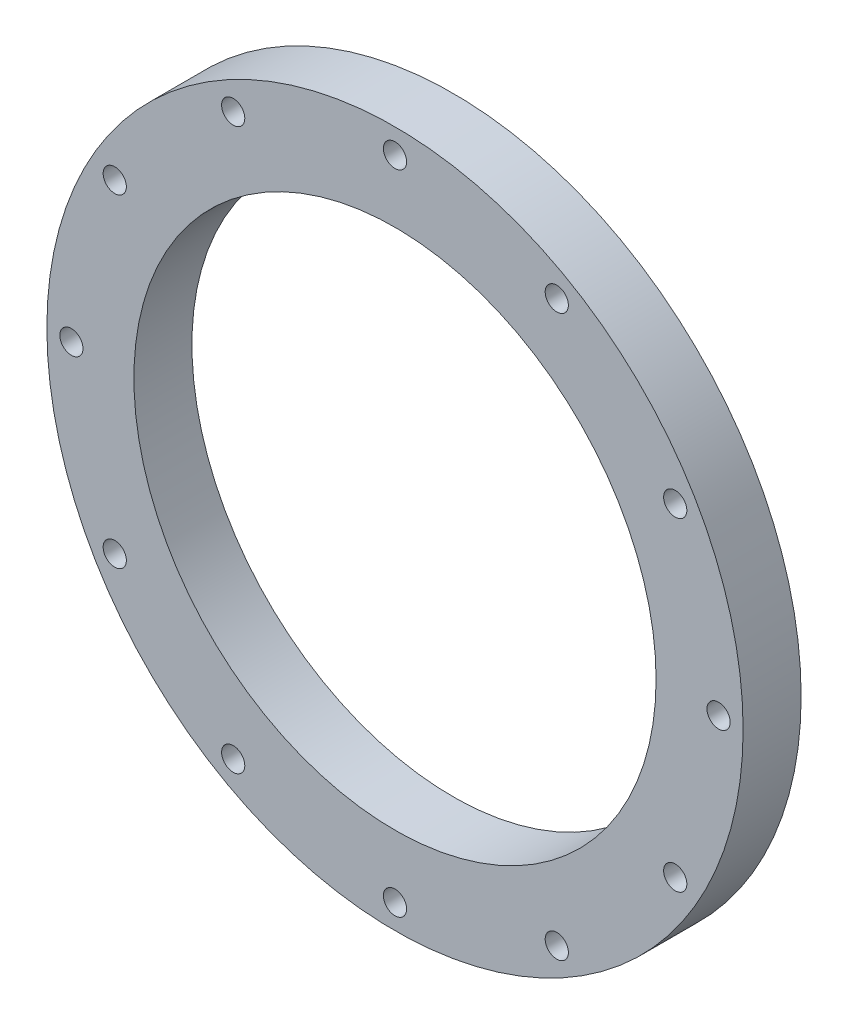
from build123d import *

# Parameters (mm, degrees)
SKETCH1_R           = 300
SKETCH1_R_2         = 225
SKETCH1_R_3         = 9.995176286
BOSS_EXTRUDE1_DEPTH = 50


with BuildPart() as part:
    # Sketch1 → Boss-Extrude1 (new body)
    with BuildSketch(Plane.XY):
        Circle(SKETCH1_R)
        Circle(SKETCH1_R_2, mode=Mode.SUBTRACT)
        with Locations((0, 278.847480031)):
            Circle(SKETCH1_R_3, mode=Mode.SUBTRACT)
        with Locations((139.423740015, 241.489001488)):
            Circle(SKETCH1_R_3, mode=Mode.SUBTRACT)
        with Locations((241.489001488, 139.423740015)):
            Circle(SKETCH1_R_3, mode=Mode.SUBTRACT)
        with Locations((278.847480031, 0)):
            Circle(SKETCH1_R_3, mode=Mode.SUBTRACT)
        with Locations((241.489001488, -139.423740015)):
            Circle(SKETCH1_R_3, mode=Mode.SUBTRACT)
        with Locations((139.423740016, -241.489001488)):
            Circle(SKETCH1_R_3, mode=Mode.SUBTRACT)
        with Locations((0, -278.847480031)):
            Circle(SKETCH1_R_3, mode=Mode.SUBTRACT)
        with Locations((-139.423740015, -241.489001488)):
            Circle(SKETCH1_R_3, mode=Mode.SUBTRACT)
        with Locations((-241.489001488, -139.423740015)):
            Circle(SKETCH1_R_3, mode=Mode.SUBTRACT)
        with Locations((-278.847480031, 0)):
            Circle(SKETCH1_R_3, mode=Mode.SUBTRACT)
        with Locations((-241.489001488, 139.423740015)):
            Circle(SKETCH1_R_3, mode=Mode.SUBTRACT)
        with Locations((-139.423740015, 241.489001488)):
            Circle(SKETCH1_R_3, mode=Mode.SUBTRACT)
    extrude(amount=BOSS_EXTRUDE1_DEPTH)


solid = part.part
